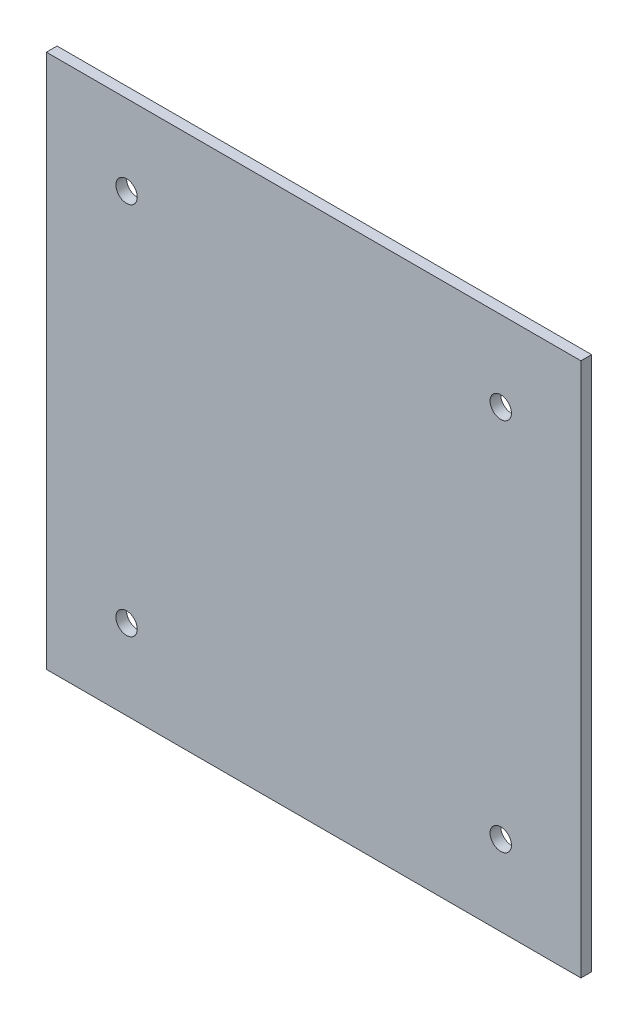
ISO-10303-21;
HEADER;
FILE_DESCRIPTION(('STEP AP214'),'2;1');
FILE_NAME('part.step','',(''),(''),'','','');
FILE_SCHEMA(('AUTOMOTIVE_DESIGN { 1 0 10303 214 1 1 1 1 }'));
ENDSEC;
DATA;
#1=APPLICATION_CONTEXT('core data for automotive mechanical design processes');
#2=APPLICATION_PROTOCOL_DEFINITION('international standard','automotive_design',2000,#1);
#3=PRODUCT_CONTEXT('',#1,'mechanical');
#4=PRODUCT('Part','Part','',(#3));
#5=PRODUCT_RELATED_PRODUCT_CATEGORY('part','',(#4));
#6=PRODUCT_DEFINITION_FORMATION('','',#4);
#7=PRODUCT_DEFINITION_CONTEXT('part definition',#1,'design');
#8=PRODUCT_DEFINITION('design','',#6,#7);
#9=PRODUCT_DEFINITION_SHAPE('','',#8);
#10=(LENGTH_UNIT() NAMED_UNIT(*) SI_UNIT(.MILLI.,.METRE.));
#11=(NAMED_UNIT(*) PLANE_ANGLE_UNIT() SI_UNIT($,.RADIAN.));
#12=(NAMED_UNIT(*) SI_UNIT($,.STERADIAN.) SOLID_ANGLE_UNIT());
#13=UNCERTAINTY_MEASURE_WITH_UNIT(LENGTH_MEASURE(1.E-05),#10,'distance_accuracy_value','');
#14=(GEOMETRIC_REPRESENTATION_CONTEXT(3) GLOBAL_UNCERTAINTY_ASSIGNED_CONTEXT((#13)) GLOBAL_UNIT_ASSIGNED_CONTEXT((#10,
#11,#12)) REPRESENTATION_CONTEXT('',''));
#15=CARTESIAN_POINT('',(0.,0.,0.));
#16=DIRECTION('',(0.,0.,1.));
#17=DIRECTION('',(1.,0.,0.));
#18=AXIS2_PLACEMENT_3D('',#15,#16,#17);
#19=CARTESIAN_POINT('',(0.,0.,4.));
#20=DIRECTION('',(1.,0.,0.));
#21=DIRECTION('',(0.,0.,-1.));
#22=AXIS2_PLACEMENT_3D('',#19,#20,#21);
#23=PLANE('',#22);
#24=DIRECTION('',(0.,-1.,0.));
#25=VECTOR('',#24,1.);
#26=CARTESIAN_POINT('',(0.,0.,0.));
#27=LINE('',#26,#25);
#28=CARTESIAN_POINT('',(0.,200.,0.));
#29=VERTEX_POINT('',#28);
#30=CARTESIAN_POINT('',(0.,0.,0.));
#31=VERTEX_POINT('',#30);
#32=EDGE_CURVE('E80',#29,#31,#27,.T.);
#33=ORIENTED_EDGE('',*,*,#32,.T.);
#34=DIRECTION('',(0.,0.,-1.));
#35=VECTOR('',#34,1.);
#36=CARTESIAN_POINT('',(0.,0.,4.));
#37=LINE('',#36,#35);
#38=CARTESIAN_POINT('',(0.,0.,4.));
#39=VERTEX_POINT('',#38);
#40=EDGE_CURVE('E87',#39,#31,#37,.T.);
#41=ORIENTED_EDGE('',*,*,#40,.F.);
#42=DIRECTION('',(0.,-1.,0.));
#43=VECTOR('',#42,1.);
#44=CARTESIAN_POINT('',(0.,0.,4.));
#45=LINE('',#44,#43);
#46=CARTESIAN_POINT('',(0.,200.,4.));
#47=VERTEX_POINT('',#46);
#48=EDGE_CURVE('E107',#47,#39,#45,.T.);
#49=ORIENTED_EDGE('',*,*,#48,.F.);
#50=DIRECTION('',(0.,0.,-1.));
#51=VECTOR('',#50,1.);
#52=CARTESIAN_POINT('',(0.,200.,4.));
#53=LINE('',#52,#51);
#54=EDGE_CURVE('E96',#47,#29,#53,.T.);
#55=ORIENTED_EDGE('',*,*,#54,.T.);
#56=EDGE_LOOP('',(#33,#41,#49,#55));
#57=FACE_BOUND('',#56,.T.);
#58=ADVANCED_FACE('F33',(#57),#23,.F.);
#59=CARTESIAN_POINT('',(0.,0.,4.));
#60=DIRECTION('',(0.,1.,0.));
#61=DIRECTION('',(0.,0.,1.));
#62=AXIS2_PLACEMENT_3D('',#59,#60,#61);
#63=PLANE('',#62);
#64=DIRECTION('',(1.,0.,0.));
#65=VECTOR('',#64,1.);
#66=CARTESIAN_POINT('',(0.,0.,0.));
#67=LINE('',#66,#65);
#68=CARTESIAN_POINT('',(200.,0.,0.));
#69=VERTEX_POINT('',#68);
#70=EDGE_CURVE('E74',#31,#69,#67,.T.);
#71=ORIENTED_EDGE('',*,*,#70,.T.);
#72=DIRECTION('',(0.,0.,-1.));
#73=VECTOR('',#72,1.);
#74=CARTESIAN_POINT('',(200.,0.,4.));
#75=LINE('',#74,#73);
#76=CARTESIAN_POINT('',(200.,0.,4.));
#77=VERTEX_POINT('',#76);
#78=EDGE_CURVE('E93',#77,#69,#75,.T.);
#79=ORIENTED_EDGE('',*,*,#78,.F.);
#80=DIRECTION('',(1.,0.,0.));
#81=VECTOR('',#80,1.);
#82=CARTESIAN_POINT('',(0.,0.,4.));
#83=LINE('',#82,#81);
#84=EDGE_CURVE('E89',#39,#77,#83,.T.);
#85=ORIENTED_EDGE('',*,*,#84,.F.);
#86=ORIENTED_EDGE('',*,*,#40,.T.);
#87=EDGE_LOOP('',(#71,#79,#85,#86));
#88=FACE_BOUND('',#87,.T.);
#89=ADVANCED_FACE('F88',(#88),#63,.F.);
#90=CARTESIAN_POINT('',(200.,0.,4.));
#91=DIRECTION('',(-1.,0.,0.));
#92=DIRECTION('',(0.,0.,1.));
#93=AXIS2_PLACEMENT_3D('',#90,#91,#92);
#94=PLANE('',#93);
#95=DIRECTION('',(0.,1.,0.));
#96=VECTOR('',#95,1.);
#97=CARTESIAN_POINT('',(200.,0.,0.));
#98=LINE('',#97,#96);
#99=CARTESIAN_POINT('',(200.,200.,0.));
#100=VERTEX_POINT('',#99);
#101=EDGE_CURVE('E81',#69,#100,#98,.T.);
#102=ORIENTED_EDGE('',*,*,#101,.T.);
#103=DIRECTION('',(0.,0.,-1.));
#104=VECTOR('',#103,1.);
#105=CARTESIAN_POINT('',(200.,200.,4.));
#106=LINE('',#105,#104);
#107=CARTESIAN_POINT('',(200.,200.,4.));
#108=VERTEX_POINT('',#107);
#109=EDGE_CURVE('E113',#108,#100,#106,.T.);
#110=ORIENTED_EDGE('',*,*,#109,.F.);
#111=DIRECTION('',(0.,1.,0.));
#112=VECTOR('',#111,1.);
#113=CARTESIAN_POINT('',(200.,0.,4.));
#114=LINE('',#113,#112);
#115=EDGE_CURVE('E53',#77,#108,#114,.T.);
#116=ORIENTED_EDGE('',*,*,#115,.F.);
#117=ORIENTED_EDGE('',*,*,#78,.T.);
#118=EDGE_LOOP('',(#102,#110,#116,#117));
#119=FACE_BOUND('',#118,.T.);
#120=ADVANCED_FACE('F142',(#119),#94,.F.);
#121=CARTESIAN_POINT('',(0.,200.,4.));
#122=DIRECTION('',(0.,-1.,0.));
#123=DIRECTION('',(0.,0.,-1.));
#124=AXIS2_PLACEMENT_3D('',#121,#122,#123);
#125=PLANE('',#124);
#126=DIRECTION('',(-1.,0.,0.));
#127=VECTOR('',#126,1.);
#128=CARTESIAN_POINT('',(0.,200.,0.));
#129=LINE('',#128,#127);
#130=EDGE_CURVE('E105',#100,#29,#129,.T.);
#131=ORIENTED_EDGE('',*,*,#130,.T.);
#132=ORIENTED_EDGE('',*,*,#54,.F.);
#133=DIRECTION('',(-1.,0.,0.));
#134=VECTOR('',#133,1.);
#135=CARTESIAN_POINT('',(0.,200.,4.));
#136=LINE('',#135,#134);
#137=EDGE_CURVE('E48',#108,#47,#136,.T.);
#138=ORIENTED_EDGE('',*,*,#137,.F.);
#139=ORIENTED_EDGE('',*,*,#109,.T.);
#140=EDGE_LOOP('',(#131,#132,#138,#139));
#141=FACE_BOUND('',#140,.T.);
#142=ADVANCED_FACE('F132',(#141),#125,.F.);
#143=CARTESIAN_POINT('',(0.,200.,4.));
#144=DIRECTION('',(0.,0.,-1.));
#145=DIRECTION('',(-1.,0.,0.));
#146=AXIS2_PLACEMENT_3D('',#143,#144,#145);
#147=PLANE('',#146);
#148=CARTESIAN_POINT('',(170.,170.,4.));
#149=DIRECTION('',(0.,0.,1.));
#150=DIRECTION('',(1.,0.,0.));
#151=AXIS2_PLACEMENT_3D('',#148,#149,#150);
#152=CIRCLE('',#151,4.00000000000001);
#153=CARTESIAN_POINT('',(174.,170.,4.));
#154=VERTEX_POINT('',#153);
#155=EDGE_CURVE('E176',#154,#154,#152,.T.);
#156=ORIENTED_EDGE('',*,*,#155,.F.);
#157=EDGE_LOOP('',(#156));
#158=FACE_BOUND('',#157,.T.);
#159=CARTESIAN_POINT('',(30.,170.,4.));
#160=DIRECTION('',(0.,0.,1.));
#161=DIRECTION('',(1.,0.,0.));
#162=AXIS2_PLACEMENT_3D('',#159,#160,#161);
#163=CIRCLE('',#162,4.00000000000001);
#164=CARTESIAN_POINT('',(34.,170.,4.));
#165=VERTEX_POINT('',#164);
#166=EDGE_CURVE('E100',#165,#165,#163,.T.);
#167=ORIENTED_EDGE('',*,*,#166,.F.);
#168=EDGE_LOOP('',(#167));
#169=FACE_BOUND('',#168,.T.);
#170=ORIENTED_EDGE('',*,*,#48,.T.);
#171=ORIENTED_EDGE('',*,*,#84,.T.);
#172=ORIENTED_EDGE('',*,*,#115,.T.);
#173=ORIENTED_EDGE('',*,*,#137,.T.);
#174=EDGE_LOOP('',(#170,#171,#172,#173));
#175=FACE_BOUND('',#174,.T.);
#176=CARTESIAN_POINT('',(30.,30.,4.));
#177=DIRECTION('',(0.,0.,1.));
#178=DIRECTION('',(1.,0.,0.));
#179=AXIS2_PLACEMENT_3D('',#176,#177,#178);
#180=CIRCLE('',#179,4.00000000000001);
#181=CARTESIAN_POINT('',(34.,30.,4.));
#182=VERTEX_POINT('',#181);
#183=EDGE_CURVE('E119',#182,#182,#180,.T.);
#184=ORIENTED_EDGE('',*,*,#183,.F.);
#185=EDGE_LOOP('',(#184));
#186=FACE_BOUND('',#185,.T.);
#187=CARTESIAN_POINT('',(170.,30.,4.));
#188=DIRECTION('',(0.,0.,1.));
#189=DIRECTION('',(1.,0.,0.));
#190=AXIS2_PLACEMENT_3D('',#187,#188,#189);
#191=CIRCLE('',#190,4.00000000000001);
#192=CARTESIAN_POINT('',(174.,30.,4.));
#193=VERTEX_POINT('',#192);
#194=EDGE_CURVE('E11',#193,#193,#191,.T.);
#195=ORIENTED_EDGE('',*,*,#194,.F.);
#196=EDGE_LOOP('',(#195));
#197=FACE_BOUND('',#196,.T.);
#198=ADVANCED_FACE('F130',(#158,#169,#175,#186,#197),#147,.F.);
#199=CARTESIAN_POINT('',(0.,200.,0.));
#200=DIRECTION('',(0.,0.,-1.));
#201=DIRECTION('',(-1.,0.,0.));
#202=AXIS2_PLACEMENT_3D('',#199,#200,#201);
#203=PLANE('',#202);
#204=CARTESIAN_POINT('',(170.,170.,0.));
#205=DIRECTION('',(0.,0.,1.));
#206=DIRECTION('',(1.,0.,0.));
#207=AXIS2_PLACEMENT_3D('',#204,#205,#206);
#208=CIRCLE('',#207,4.00000000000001);
#209=CARTESIAN_POINT('',(174.,170.,0.));
#210=VERTEX_POINT('',#209);
#211=EDGE_CURVE('E174',#210,#210,#208,.T.);
#212=ORIENTED_EDGE('',*,*,#211,.T.);
#213=EDGE_LOOP('',(#212));
#214=FACE_BOUND('',#213,.T.);
#215=CARTESIAN_POINT('',(30.,170.,0.));
#216=DIRECTION('',(0.,0.,1.));
#217=DIRECTION('',(1.,0.,0.));
#218=AXIS2_PLACEMENT_3D('',#215,#216,#217);
#219=CIRCLE('',#218,4.00000000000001);
#220=CARTESIAN_POINT('',(34.,170.,0.));
#221=VERTEX_POINT('',#220);
#222=EDGE_CURVE('E97',#221,#221,#219,.T.);
#223=ORIENTED_EDGE('',*,*,#222,.T.);
#224=EDGE_LOOP('',(#223));
#225=FACE_BOUND('',#224,.T.);
#226=ORIENTED_EDGE('',*,*,#32,.F.);
#227=ORIENTED_EDGE('',*,*,#130,.F.);
#228=ORIENTED_EDGE('',*,*,#101,.F.);
#229=ORIENTED_EDGE('',*,*,#70,.F.);
#230=EDGE_LOOP('',(#226,#227,#228,#229));
#231=FACE_BOUND('',#230,.T.);
#232=CARTESIAN_POINT('',(30.,30.,0.));
#233=DIRECTION('',(0.,0.,1.));
#234=DIRECTION('',(1.,0.,0.));
#235=AXIS2_PLACEMENT_3D('',#232,#233,#234);
#236=CIRCLE('',#235,4.00000000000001);
#237=CARTESIAN_POINT('',(34.,30.,0.));
#238=VERTEX_POINT('',#237);
#239=EDGE_CURVE('E92',#238,#238,#236,.T.);
#240=ORIENTED_EDGE('',*,*,#239,.T.);
#241=EDGE_LOOP('',(#240));
#242=FACE_BOUND('',#241,.T.);
#243=CARTESIAN_POINT('',(170.,30.,0.));
#244=DIRECTION('',(0.,0.,1.));
#245=DIRECTION('',(1.,0.,0.));
#246=AXIS2_PLACEMENT_3D('',#243,#244,#245);
#247=CIRCLE('',#246,4.00000000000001);
#248=CARTESIAN_POINT('',(174.,30.,0.));
#249=VERTEX_POINT('',#248);
#250=EDGE_CURVE('E41',#249,#249,#247,.T.);
#251=ORIENTED_EDGE('',*,*,#250,.T.);
#252=EDGE_LOOP('',(#251));
#253=FACE_BOUND('',#252,.T.);
#254=ADVANCED_FACE('F76',(#214,#225,#231,#242,#253),#203,.T.);
#255=CARTESIAN_POINT('',(30.,170.,0.));
#256=DIRECTION('',(0.,0.,1.));
#257=DIRECTION('',(1.,0.,0.));
#258=AXIS2_PLACEMENT_3D('',#255,#256,#257);
#259=CYLINDRICAL_SURFACE('',#258,4.00000000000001);
#260=ORIENTED_EDGE('',*,*,#222,.F.);
#261=EDGE_LOOP('',(#260));
#262=FACE_BOUND('',#261,.T.);
#263=ORIENTED_EDGE('',*,*,#166,.T.);
#264=EDGE_LOOP('',(#263));
#265=FACE_BOUND('',#264,.T.);
#266=ADVANCED_FACE('F139',(#262,#265),#259,.F.);
#267=CARTESIAN_POINT('',(170.,170.,0.));
#268=DIRECTION('',(0.,0.,1.));
#269=DIRECTION('',(1.,0.,0.));
#270=AXIS2_PLACEMENT_3D('',#267,#268,#269);
#271=CYLINDRICAL_SURFACE('',#270,4.00000000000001);
#272=ORIENTED_EDGE('',*,*,#211,.F.);
#273=EDGE_LOOP('',(#272));
#274=FACE_BOUND('',#273,.T.);
#275=ORIENTED_EDGE('',*,*,#155,.T.);
#276=EDGE_LOOP('',(#275));
#277=FACE_BOUND('',#276,.T.);
#278=ADVANCED_FACE('F155',(#274,#277),#271,.F.);
#279=CARTESIAN_POINT('',(30.,30.,0.));
#280=DIRECTION('',(0.,0.,1.));
#281=DIRECTION('',(1.,0.,0.));
#282=AXIS2_PLACEMENT_3D('',#279,#280,#281);
#283=CYLINDRICAL_SURFACE('',#282,4.00000000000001);
#284=ORIENTED_EDGE('',*,*,#239,.F.);
#285=EDGE_LOOP('',(#284));
#286=FACE_BOUND('',#285,.T.);
#287=ORIENTED_EDGE('',*,*,#183,.T.);
#288=EDGE_LOOP('',(#287));
#289=FACE_BOUND('',#288,.T.);
#290=ADVANCED_FACE('F127',(#286,#289),#283,.F.);
#291=CARTESIAN_POINT('',(170.,30.,0.));
#292=DIRECTION('',(0.,0.,1.));
#293=DIRECTION('',(1.,0.,0.));
#294=AXIS2_PLACEMENT_3D('',#291,#292,#293);
#295=CYLINDRICAL_SURFACE('',#294,4.00000000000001);
#296=ORIENTED_EDGE('',*,*,#250,.F.);
#297=EDGE_LOOP('',(#296));
#298=FACE_BOUND('',#297,.T.);
#299=ORIENTED_EDGE('',*,*,#194,.T.);
#300=EDGE_LOOP('',(#299));
#301=FACE_BOUND('',#300,.T.);
#302=ADVANCED_FACE('F35',(#298,#301),#295,.F.);
#303=CLOSED_SHELL('',(#58,#89,#120,#142,#198,#254,#266,#278,#290,#302));
#304=MANIFOLD_SOLID_BREP('B2',#303);
#305=ADVANCED_BREP_SHAPE_REPRESENTATION('',(#18,#304),#14);
#306=SHAPE_DEFINITION_REPRESENTATION(#9,#305);
ENDSEC;
END-ISO-10303-21;
